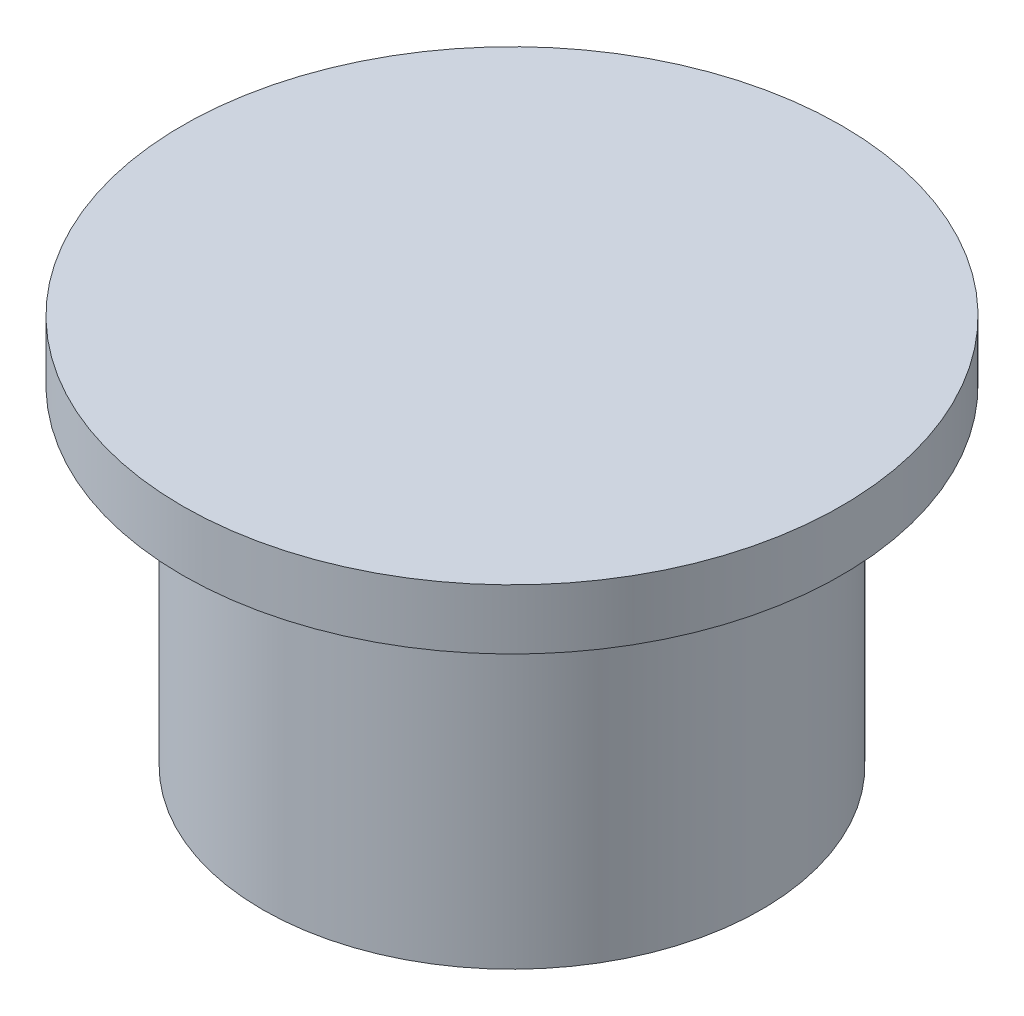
ISO-10303-21;
HEADER;
FILE_DESCRIPTION(('STEP AP214'),'2;1');
FILE_NAME('part.step','',(''),(''),'','','');
FILE_SCHEMA(('AUTOMOTIVE_DESIGN { 1 0 10303 214 1 1 1 1 }'));
ENDSEC;
DATA;
#1=APPLICATION_CONTEXT('core data for automotive mechanical design processes');
#2=APPLICATION_PROTOCOL_DEFINITION('international standard','automotive_design',2000,#1);
#3=PRODUCT_CONTEXT('',#1,'mechanical');
#4=PRODUCT('Part','Part','',(#3));
#5=PRODUCT_RELATED_PRODUCT_CATEGORY('part','',(#4));
#6=PRODUCT_DEFINITION_FORMATION('','',#4);
#7=PRODUCT_DEFINITION_CONTEXT('part definition',#1,'design');
#8=PRODUCT_DEFINITION('design','',#6,#7);
#9=PRODUCT_DEFINITION_SHAPE('','',#8);
#10=(LENGTH_UNIT() NAMED_UNIT(*) SI_UNIT(.MILLI.,.METRE.));
#11=(NAMED_UNIT(*) PLANE_ANGLE_UNIT() SI_UNIT($,.RADIAN.));
#12=(NAMED_UNIT(*) SI_UNIT($,.STERADIAN.) SOLID_ANGLE_UNIT());
#13=UNCERTAINTY_MEASURE_WITH_UNIT(LENGTH_MEASURE(1.E-05),#10,'distance_accuracy_value','');
#14=(GEOMETRIC_REPRESENTATION_CONTEXT(3) GLOBAL_UNCERTAINTY_ASSIGNED_CONTEXT((#13)) GLOBAL_UNIT_ASSIGNED_CONTEXT((#10,
#11,#12)) REPRESENTATION_CONTEXT('',''));
#15=CARTESIAN_POINT('',(0.,0.,0.));
#16=DIRECTION('',(0.,0.,1.));
#17=DIRECTION('',(1.,0.,0.));
#18=AXIS2_PLACEMENT_3D('',#15,#16,#17);
#19=CARTESIAN_POINT('',(0.,11.,0.));
#20=DIRECTION('',(0.,-1.,0.));
#21=DIRECTION('',(0.,0.,-1.));
#22=AXIS2_PLACEMENT_3D('',#19,#20,#21);
#23=CYLINDRICAL_SURFACE('',#22,8.33);
#24=CARTESIAN_POINT('',(0.,11.,0.));
#25=DIRECTION('',(0.,1.,0.));
#26=DIRECTION('',(0.,0.,1.));
#27=AXIS2_PLACEMENT_3D('',#24,#25,#26);
#28=CIRCLE('',#27,8.33);
#29=CARTESIAN_POINT('',(0.,11.,8.33));
#30=VERTEX_POINT('',#29);
#31=EDGE_CURVE('E10',#30,#30,#28,.T.);
#32=ORIENTED_EDGE('',*,*,#31,.F.);
#33=EDGE_LOOP('',(#32));
#34=FACE_BOUND('',#33,.T.);
#35=CARTESIAN_POINT('',(0.,0.,0.));
#36=DIRECTION('',(0.,1.,0.));
#37=DIRECTION('',(0.,0.,1.));
#38=AXIS2_PLACEMENT_3D('',#35,#36,#37);
#39=CIRCLE('',#38,8.33);
#40=CARTESIAN_POINT('',(0.,0.,8.33));
#41=VERTEX_POINT('',#40);
#42=EDGE_CURVE('E34',#41,#41,#39,.T.);
#43=ORIENTED_EDGE('',*,*,#42,.T.);
#44=EDGE_LOOP('',(#43));
#45=FACE_BOUND('',#44,.T.);
#46=ADVANCED_FACE('F31',(#34,#45),#23,.T.);
#47=CARTESIAN_POINT('',(0.,0.,0.));
#48=DIRECTION('',(0.,1.,0.));
#49=DIRECTION('',(0.,0.,1.));
#50=AXIS2_PLACEMENT_3D('',#47,#48,#49);
#51=PLANE('',#50);
#52=ORIENTED_EDGE('',*,*,#42,.F.);
#53=EDGE_LOOP('',(#52));
#54=FACE_BOUND('',#53,.T.);
#55=ADVANCED_FACE('F59',(#54),#51,.F.);
#56=CARTESIAN_POINT('',(0.,11.,0.));
#57=DIRECTION('',(0.,1.,0.));
#58=DIRECTION('',(0.,0.,1.));
#59=AXIS2_PLACEMENT_3D('',#56,#57,#58);
#60=PLANE('',#59);
#61=CARTESIAN_POINT('',(0.,11.,0.));
#62=DIRECTION('',(0.,1.,0.));
#63=DIRECTION('',(0.,0.,1.));
#64=AXIS2_PLACEMENT_3D('',#61,#62,#63);
#65=CIRCLE('',#64,11.);
#66=CARTESIAN_POINT('',(0.,11.,11.));
#67=VERTEX_POINT('',#66);
#68=EDGE_CURVE('E43',#67,#67,#65,.T.);
#69=ORIENTED_EDGE('',*,*,#68,.F.);
#70=EDGE_LOOP('',(#69));
#71=FACE_BOUND('',#70,.T.);
#72=ORIENTED_EDGE('',*,*,#31,.T.);
#73=EDGE_LOOP('',(#72));
#74=FACE_BOUND('',#73,.T.);
#75=ADVANCED_FACE('F54',(#71,#74),#60,.F.);
#76=CARTESIAN_POINT('',(0.,13.,0.));
#77=DIRECTION('',(0.,-1.,0.));
#78=DIRECTION('',(0.,0.,-1.));
#79=AXIS2_PLACEMENT_3D('',#76,#77,#78);
#80=CYLINDRICAL_SURFACE('',#79,11.);
#81=CARTESIAN_POINT('',(0.,13.,0.));
#82=DIRECTION('',(0.,1.,0.));
#83=DIRECTION('',(0.,0.,1.));
#84=AXIS2_PLACEMENT_3D('',#81,#82,#83);
#85=CIRCLE('',#84,11.);
#86=CARTESIAN_POINT('',(0.,13.,11.));
#87=VERTEX_POINT('',#86);
#88=EDGE_CURVE('E41',#87,#87,#85,.T.);
#89=ORIENTED_EDGE('',*,*,#88,.F.);
#90=EDGE_LOOP('',(#89));
#91=FACE_BOUND('',#90,.T.);
#92=ORIENTED_EDGE('',*,*,#68,.T.);
#93=EDGE_LOOP('',(#92));
#94=FACE_BOUND('',#93,.T.);
#95=ADVANCED_FACE('F51',(#91,#94),#80,.T.);
#96=CARTESIAN_POINT('',(0.,13.,0.));
#97=DIRECTION('',(0.,1.,0.));
#98=DIRECTION('',(0.,0.,1.));
#99=AXIS2_PLACEMENT_3D('',#96,#97,#98);
#100=PLANE('',#99);
#101=ORIENTED_EDGE('',*,*,#88,.T.);
#102=EDGE_LOOP('',(#101));
#103=FACE_BOUND('',#102,.T.);
#104=ADVANCED_FACE('F49',(#103),#100,.T.);
#105=CLOSED_SHELL('',(#46,#55,#75,#95,#104));
#106=MANIFOLD_SOLID_BREP('B2',#105);
#107=ADVANCED_BREP_SHAPE_REPRESENTATION('',(#18,#106),#14);
#108=SHAPE_DEFINITION_REPRESENTATION(#9,#107);
ENDSEC;
END-ISO-10303-21;
